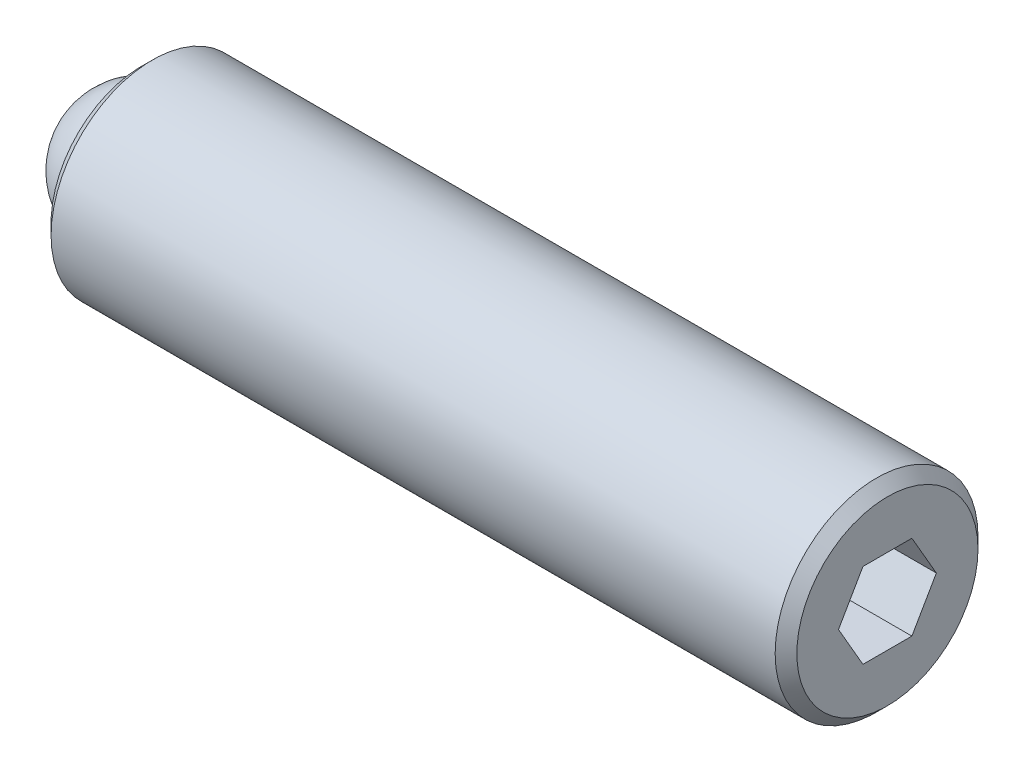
ISO-10303-21;
HEADER;
FILE_DESCRIPTION(('STEP AP214'),'2;1');
FILE_NAME('part.step','',(''),(''),'','','');
FILE_SCHEMA(('AUTOMOTIVE_DESIGN { 1 0 10303 214 1 1 1 1 }'));
ENDSEC;
DATA;
#1=APPLICATION_CONTEXT('core data for automotive mechanical design processes');
#2=APPLICATION_PROTOCOL_DEFINITION('international standard','automotive_design',2000,#1);
#3=PRODUCT_CONTEXT('',#1,'mechanical');
#4=PRODUCT('Part','Part','',(#3));
#5=PRODUCT_RELATED_PRODUCT_CATEGORY('part','',(#4));
#6=PRODUCT_DEFINITION_FORMATION('','',#4);
#7=PRODUCT_DEFINITION_CONTEXT('part definition',#1,'design');
#8=PRODUCT_DEFINITION('design','',#6,#7);
#9=PRODUCT_DEFINITION_SHAPE('','',#8);
#10=(LENGTH_UNIT() NAMED_UNIT(*) SI_UNIT(.MILLI.,.METRE.));
#11=(NAMED_UNIT(*) PLANE_ANGLE_UNIT() SI_UNIT($,.RADIAN.));
#12=(NAMED_UNIT(*) SI_UNIT($,.STERADIAN.) SOLID_ANGLE_UNIT());
#13=UNCERTAINTY_MEASURE_WITH_UNIT(LENGTH_MEASURE(1.E-05),#10,'distance_accuracy_value','');
#14=(GEOMETRIC_REPRESENTATION_CONTEXT(3) GLOBAL_UNCERTAINTY_ASSIGNED_CONTEXT((#13)) GLOBAL_UNIT_ASSIGNED_CONTEXT((#10,
#11,#12)) REPRESENTATION_CONTEXT('',''));
#15=CARTESIAN_POINT('',(0.,0.,0.));
#16=DIRECTION('',(0.,0.,1.));
#17=DIRECTION('',(1.,0.,0.));
#18=AXIS2_PLACEMENT_3D('',#15,#16,#17);
#19=CARTESIAN_POINT('',(0.,0.,0.));
#20=DIRECTION('',(0.,-1.,0.));
#21=DIRECTION('',(0.,0.,1.));
#22=AXIS2_PLACEMENT_3D('',#19,#20,#21);
#23=SPHERICAL_SURFACE('',#22,1.5875);
#24=CARTESIAN_POINT('',(0.,-1.5875,0.));
#25=VERTEX_POINT('',#24);
#26=VERTEX_LOOP('',#25);
#27=FACE_BOUND('',#26,.T.);
#28=ADVANCED_FACE('F41',(#27),#23,.T.);
#29=CLOSED_SHELL('',(#28));
#30=MANIFOLD_SOLID_BREP('B2',#29);
#31=CARTESIAN_POINT('',(17.4625,0.,0.));
#32=DIRECTION('',(-1.,0.,0.));
#33=DIRECTION('',(0.,0.,1.));
#34=AXIS2_PLACEMENT_3D('',#31,#32,#33);
#35=CYLINDRICAL_SURFACE('',#34,2.3749);
#36=CARTESIAN_POINT('',(17.2085,0.,0.));
#37=DIRECTION('',(1.,0.,0.));
#38=DIRECTION('',(0.,0.,-1.));
#39=AXIS2_PLACEMENT_3D('',#36,#37,#38);
#40=CIRCLE('',#39,2.3749);
#41=CARTESIAN_POINT('',(17.2085,0.,-2.3749));
#42=VERTEX_POINT('',#41);
#43=EDGE_CURVE('E39',#42,#42,#40,.F.);
#44=ORIENTED_EDGE('',*,*,#43,.T.);
#45=EDGE_LOOP('',(#44));
#46=FACE_BOUND('',#45,.T.);
#47=CARTESIAN_POINT('',(0.254000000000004,0.,0.));
#48=DIRECTION('',(1.,0.,0.));
#49=DIRECTION('',(0.,0.,-1.));
#50=AXIS2_PLACEMENT_3D('',#47,#48,#49);
#51=CIRCLE('',#50,2.3749);
#52=CARTESIAN_POINT('',(0.254000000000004,0.,-2.3749));
#53=VERTEX_POINT('',#52);
#54=EDGE_CURVE('E157',#53,#53,#51,.T.);
#55=ORIENTED_EDGE('',*,*,#54,.T.);
#56=EDGE_LOOP('',(#55));
#57=FACE_BOUND('',#56,.T.);
#58=ADVANCED_FACE('F54',(#46,#57),#35,.T.);
#59=CARTESIAN_POINT('',(17.4625,0.,0.));
#60=DIRECTION('',(1.,0.,0.));
#61=DIRECTION('',(0.,0.,-1.));
#62=AXIS2_PLACEMENT_3D('',#59,#60,#61);
#63=PLANE('',#62);
#64=DIRECTION('',(0.,0.866025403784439,-0.5));
#65=VECTOR('',#64,1.);
#66=CARTESIAN_POINT('',(17.4625,-0.992187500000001,-0.572839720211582));
#67=LINE('',#66,#65);
#68=CARTESIAN_POINT('',(17.4625,-0.992187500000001,-0.572839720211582));
#69=VERTEX_POINT('',#68);
#70=CARTESIAN_POINT('',(17.4625,0.,-1.14567944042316));
#71=VERTEX_POINT('',#70);
#72=EDGE_CURVE('E69',#69,#71,#67,.T.);
#73=ORIENTED_EDGE('',*,*,#72,.F.);
#74=DIRECTION('',(0.,0.,-1.));
#75=VECTOR('',#74,1.);
#76=CARTESIAN_POINT('',(17.4625,-0.992187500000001,0.572839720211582));
#77=LINE('',#76,#75);
#78=CARTESIAN_POINT('',(17.4625,-0.992187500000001,0.572839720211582));
#79=VERTEX_POINT('',#78);
#80=EDGE_CURVE('E153',#79,#69,#77,.T.);
#81=ORIENTED_EDGE('',*,*,#80,.F.);
#82=DIRECTION('',(0.,-0.866025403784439,-0.5));
#83=VECTOR('',#82,1.);
#84=CARTESIAN_POINT('',(17.4625,0.,1.14567944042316));
#85=LINE('',#84,#83);
#86=CARTESIAN_POINT('',(17.4625,0.,1.14567944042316));
#87=VERTEX_POINT('',#86);
#88=EDGE_CURVE('E151',#87,#79,#85,.T.);
#89=ORIENTED_EDGE('',*,*,#88,.F.);
#90=DIRECTION('',(0.,-0.866025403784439,0.5));
#91=VECTOR('',#90,1.);
#92=CARTESIAN_POINT('',(17.4625,0.992187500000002,0.572839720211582));
#93=LINE('',#92,#91);
#94=CARTESIAN_POINT('',(17.4625,0.992187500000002,0.572839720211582));
#95=VERTEX_POINT('',#94);
#96=EDGE_CURVE('E117',#95,#87,#93,.T.);
#97=ORIENTED_EDGE('',*,*,#96,.F.);
#98=DIRECTION('',(0.,0.,1.));
#99=VECTOR('',#98,1.);
#100=CARTESIAN_POINT('',(17.4625,0.992187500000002,-0.572839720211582));
#101=LINE('',#100,#99);
#102=CARTESIAN_POINT('',(17.4625,0.992187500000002,-0.572839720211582));
#103=VERTEX_POINT('',#102);
#104=EDGE_CURVE('E147',#103,#95,#101,.T.);
#105=ORIENTED_EDGE('',*,*,#104,.F.);
#106=DIRECTION('',(0.,0.866025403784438,0.5));
#107=VECTOR('',#106,1.);
#108=CARTESIAN_POINT('',(17.4625,0.,-1.14567944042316));
#109=LINE('',#108,#107);
#110=EDGE_CURVE('E143',#71,#103,#109,.T.);
#111=ORIENTED_EDGE('',*,*,#110,.F.);
#112=EDGE_LOOP('',(#73,#81,#89,#97,#105,#111));
#113=FACE_BOUND('',#112,.T.);
#114=CARTESIAN_POINT('',(17.4625,0.,0.));
#115=DIRECTION('',(1.,0.,0.));
#116=DIRECTION('',(0.,0.,-1.));
#117=AXIS2_PLACEMENT_3D('',#114,#115,#116);
#118=CIRCLE('',#117,2.1209);
#119=CARTESIAN_POINT('',(17.4625,0.,-2.1209));
#120=VERTEX_POINT('',#119);
#121=EDGE_CURVE('E62',#120,#120,#118,.T.);
#122=ORIENTED_EDGE('',*,*,#121,.T.);
#123=EDGE_LOOP('',(#122));
#124=FACE_BOUND('',#123,.T.);
#125=ADVANCED_FACE('F170',(#113,#124),#63,.T.);
#126=CARTESIAN_POINT('',(0.,0.,0.));
#127=DIRECTION('',(1.,0.,0.));
#128=DIRECTION('',(0.,0.,-1.));
#129=AXIS2_PLACEMENT_3D('',#126,#127,#128);
#130=PLANE('',#129);
#131=CARTESIAN_POINT('',(0.,0.,0.));
#132=DIRECTION('',(-1.,0.,0.));
#133=DIRECTION('',(0.,0.,1.));
#134=AXIS2_PLACEMENT_3D('',#131,#132,#133);
#135=CIRCLE('',#134,1.5875);
#136=CARTESIAN_POINT('',(0.,0.,1.5875));
#137=VERTEX_POINT('',#136);
#138=EDGE_CURVE('E225',#137,#137,#135,.T.);
#139=ORIENTED_EDGE('',*,*,#138,.F.);
#140=EDGE_LOOP('',(#139));
#141=FACE_BOUND('',#140,.T.);
#142=CARTESIAN_POINT('',(0.,0.,0.));
#143=DIRECTION('',(1.,0.,0.));
#144=DIRECTION('',(0.,0.,-1.));
#145=AXIS2_PLACEMENT_3D('',#142,#143,#144);
#146=CIRCLE('',#145,2.12089999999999);
#147=CARTESIAN_POINT('',(0.,0.,-2.12089999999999));
#148=VERTEX_POINT('',#147);
#149=EDGE_CURVE('E165',#148,#148,#146,.F.);
#150=ORIENTED_EDGE('',*,*,#149,.T.);
#151=EDGE_LOOP('',(#150));
#152=FACE_BOUND('',#151,.T.);
#153=ADVANCED_FACE('F182',(#141,#152),#130,.F.);
#154=CARTESIAN_POINT('',(0.254000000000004,0.,0.));
#155=DIRECTION('',(1.,0.,0.));
#156=DIRECTION('',(0.,0.,-1.));
#157=AXIS2_PLACEMENT_3D('',#154,#155,#156);
#158=CONICAL_SURFACE('',#157,2.3749,0.785398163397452);
#159=ORIENTED_EDGE('',*,*,#149,.F.);
#160=EDGE_LOOP('',(#159));
#161=FACE_BOUND('',#160,.T.);
#162=ORIENTED_EDGE('',*,*,#54,.F.);
#163=EDGE_LOOP('',(#162));
#164=FACE_BOUND('',#163,.T.);
#165=ADVANCED_FACE('F174',(#161,#164),#158,.T.);
#166=CARTESIAN_POINT('',(17.4625,0.,0.));
#167=DIRECTION('',(-1.,0.,0.));
#168=DIRECTION('',(0.,0.,1.));
#169=AXIS2_PLACEMENT_3D('',#166,#167,#168);
#170=CONICAL_SURFACE('',#169,2.1209,0.785398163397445);
#171=ORIENTED_EDGE('',*,*,#43,.F.);
#172=EDGE_LOOP('',(#171));
#173=FACE_BOUND('',#172,.T.);
#174=ORIENTED_EDGE('',*,*,#121,.F.);
#175=EDGE_LOOP('',(#174));
#176=FACE_BOUND('',#175,.T.);
#177=ADVANCED_FACE('F56',(#173,#176),#170,.T.);
#178=CARTESIAN_POINT('',(15.1765,-0.992187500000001,-0.572839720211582));
#179=DIRECTION('',(0.,-0.5,-0.866025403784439));
#180=DIRECTION('',(0.,0.866025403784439,-0.5));
#181=AXIS2_PLACEMENT_3D('',#178,#179,#180);
#182=PLANE('',#181);
#183=ORIENTED_EDGE('',*,*,#72,.T.);
#184=DIRECTION('',(1.,0.,0.));
#185=VECTOR('',#184,1.);
#186=CARTESIAN_POINT('',(15.1765,0.,-1.14567944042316));
#187=LINE('',#186,#185);
#188=CARTESIAN_POINT('',(15.1765,0.,-1.14567944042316));
#189=VERTEX_POINT('',#188);
#190=EDGE_CURVE('E99',#189,#71,#187,.T.);
#191=ORIENTED_EDGE('',*,*,#190,.F.);
#192=DIRECTION('',(0.,0.866025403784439,-0.5));
#193=VECTOR('',#192,1.);
#194=CARTESIAN_POINT('',(15.1765,-0.992187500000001,-0.572839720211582));
#195=LINE('',#194,#193);
#196=CARTESIAN_POINT('',(15.1765,-0.992187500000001,-0.572839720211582));
#197=VERTEX_POINT('',#196);
#198=EDGE_CURVE('E155',#197,#189,#195,.T.);
#199=ORIENTED_EDGE('',*,*,#198,.F.);
#200=DIRECTION('',(1.,0.,0.));
#201=VECTOR('',#200,1.);
#202=CARTESIAN_POINT('',(15.1765,-0.992187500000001,-0.572839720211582));
#203=LINE('',#202,#201);
#204=EDGE_CURVE('E77',#197,#69,#203,.T.);
#205=ORIENTED_EDGE('',*,*,#204,.T.);
#206=EDGE_LOOP('',(#183,#191,#199,#205));
#207=FACE_BOUND('',#206,.T.);
#208=ADVANCED_FACE('F173',(#207),#182,.F.);
#209=CARTESIAN_POINT('',(15.1765,-0.992187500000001,0.572839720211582));
#210=DIRECTION('',(0.,-1.,0.));
#211=DIRECTION('',(0.,0.,-1.));
#212=AXIS2_PLACEMENT_3D('',#209,#210,#211);
#213=PLANE('',#212);
#214=ORIENTED_EDGE('',*,*,#80,.T.);
#215=ORIENTED_EDGE('',*,*,#204,.F.);
#216=DIRECTION('',(0.,0.,-1.));
#217=VECTOR('',#216,1.);
#218=CARTESIAN_POINT('',(15.1765,-0.992187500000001,0.572839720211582));
#219=LINE('',#218,#217);
#220=CARTESIAN_POINT('',(15.1765,-0.992187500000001,0.572839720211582));
#221=VERTEX_POINT('',#220);
#222=EDGE_CURVE('E129',#221,#197,#219,.T.);
#223=ORIENTED_EDGE('',*,*,#222,.F.);
#224=DIRECTION('',(1.,0.,0.));
#225=VECTOR('',#224,1.);
#226=CARTESIAN_POINT('',(15.1765,-0.992187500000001,0.572839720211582));
#227=LINE('',#226,#225);
#228=EDGE_CURVE('E121',#221,#79,#227,.T.);
#229=ORIENTED_EDGE('',*,*,#228,.T.);
#230=EDGE_LOOP('',(#214,#215,#223,#229));
#231=FACE_BOUND('',#230,.T.);
#232=ADVANCED_FACE('F180',(#231),#213,.F.);
#233=CARTESIAN_POINT('',(15.1765,0.,1.14567944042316));
#234=DIRECTION('',(0.,-0.5,0.866025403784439));
#235=DIRECTION('',(0.,-0.866025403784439,-0.5));
#236=AXIS2_PLACEMENT_3D('',#233,#234,#235);
#237=PLANE('',#236);
#238=ORIENTED_EDGE('',*,*,#88,.T.);
#239=ORIENTED_EDGE('',*,*,#228,.F.);
#240=DIRECTION('',(0.,-0.866025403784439,-0.5));
#241=VECTOR('',#240,1.);
#242=CARTESIAN_POINT('',(15.1765,0.,1.14567944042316));
#243=LINE('',#242,#241);
#244=CARTESIAN_POINT('',(15.1765,0.,1.14567944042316));
#245=VERTEX_POINT('',#244);
#246=EDGE_CURVE('E125',#245,#221,#243,.T.);
#247=ORIENTED_EDGE('',*,*,#246,.F.);
#248=DIRECTION('',(1.,0.,0.));
#249=VECTOR('',#248,1.);
#250=CARTESIAN_POINT('',(15.1765,0.,1.14567944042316));
#251=LINE('',#250,#249);
#252=EDGE_CURVE('E110',#245,#87,#251,.T.);
#253=ORIENTED_EDGE('',*,*,#252,.T.);
#254=EDGE_LOOP('',(#238,#239,#247,#253));
#255=FACE_BOUND('',#254,.T.);
#256=ADVANCED_FACE('F126',(#255),#237,.F.);
#257=CARTESIAN_POINT('',(15.1765,0.992187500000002,0.572839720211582));
#258=DIRECTION('',(0.,0.5,0.866025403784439));
#259=DIRECTION('',(0.,-0.866025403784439,0.5));
#260=AXIS2_PLACEMENT_3D('',#257,#258,#259);
#261=PLANE('',#260);
#262=ORIENTED_EDGE('',*,*,#96,.T.);
#263=ORIENTED_EDGE('',*,*,#252,.F.);
#264=DIRECTION('',(0.,-0.866025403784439,0.5));
#265=VECTOR('',#264,1.);
#266=CARTESIAN_POINT('',(15.1765,0.992187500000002,0.572839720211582));
#267=LINE('',#266,#265);
#268=CARTESIAN_POINT('',(15.1765,0.992187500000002,0.572839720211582));
#269=VERTEX_POINT('',#268);
#270=EDGE_CURVE('E114',#269,#245,#267,.T.);
#271=ORIENTED_EDGE('',*,*,#270,.F.);
#272=DIRECTION('',(1.,0.,0.));
#273=VECTOR('',#272,1.);
#274=CARTESIAN_POINT('',(15.1765,0.992187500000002,0.572839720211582));
#275=LINE('',#274,#273);
#276=EDGE_CURVE('E122',#269,#95,#275,.T.);
#277=ORIENTED_EDGE('',*,*,#276,.T.);
#278=EDGE_LOOP('',(#262,#263,#271,#277));
#279=FACE_BOUND('',#278,.T.);
#280=ADVANCED_FACE('F112',(#279),#261,.F.);
#281=CARTESIAN_POINT('',(15.1765,0.992187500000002,-0.572839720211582));
#282=DIRECTION('',(0.,1.,0.));
#283=DIRECTION('',(0.,0.,1.));
#284=AXIS2_PLACEMENT_3D('',#281,#282,#283);
#285=PLANE('',#284);
#286=ORIENTED_EDGE('',*,*,#104,.T.);
#287=ORIENTED_EDGE('',*,*,#276,.F.);
#288=DIRECTION('',(0.,0.,1.));
#289=VECTOR('',#288,1.);
#290=CARTESIAN_POINT('',(15.1765,0.992187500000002,-0.572839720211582));
#291=LINE('',#290,#289);
#292=CARTESIAN_POINT('',(15.1765,0.992187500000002,-0.572839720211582));
#293=VERTEX_POINT('',#292);
#294=EDGE_CURVE('E135',#293,#269,#291,.T.);
#295=ORIENTED_EDGE('',*,*,#294,.F.);
#296=DIRECTION('',(1.,0.,0.));
#297=VECTOR('',#296,1.);
#298=CARTESIAN_POINT('',(15.1765,0.992187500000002,-0.572839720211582));
#299=LINE('',#298,#297);
#300=EDGE_CURVE('E160',#293,#103,#299,.T.);
#301=ORIENTED_EDGE('',*,*,#300,.T.);
#302=EDGE_LOOP('',(#286,#287,#295,#301));
#303=FACE_BOUND('',#302,.T.);
#304=ADVANCED_FACE('F201',(#303),#285,.F.);
#305=CARTESIAN_POINT('',(15.1765,0.,-1.14567944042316));
#306=DIRECTION('',(0.,0.5,-0.866025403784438));
#307=DIRECTION('',(0.,0.866025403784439,0.5));
#308=AXIS2_PLACEMENT_3D('',#305,#306,#307);
#309=PLANE('',#308);
#310=ORIENTED_EDGE('',*,*,#110,.T.);
#311=ORIENTED_EDGE('',*,*,#300,.F.);
#312=DIRECTION('',(0.,0.866025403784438,0.5));
#313=VECTOR('',#312,1.);
#314=CARTESIAN_POINT('',(15.1765,0.,-1.14567944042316));
#315=LINE('',#314,#313);
#316=EDGE_CURVE('E137',#189,#293,#315,.T.);
#317=ORIENTED_EDGE('',*,*,#316,.F.);
#318=ORIENTED_EDGE('',*,*,#190,.T.);
#319=EDGE_LOOP('',(#310,#311,#317,#318));
#320=FACE_BOUND('',#319,.T.);
#321=ADVANCED_FACE('F198',(#320),#309,.F.);
#322=CARTESIAN_POINT('',(15.1765,0.,0.));
#323=DIRECTION('',(1.,0.,0.));
#324=DIRECTION('',(0.,0.,-1.));
#325=AXIS2_PLACEMENT_3D('',#322,#323,#324);
#326=PLANE('',#325);
#327=ORIENTED_EDGE('',*,*,#198,.T.);
#328=ORIENTED_EDGE('',*,*,#316,.T.);
#329=ORIENTED_EDGE('',*,*,#294,.T.);
#330=ORIENTED_EDGE('',*,*,#270,.T.);
#331=ORIENTED_EDGE('',*,*,#246,.T.);
#332=ORIENTED_EDGE('',*,*,#222,.T.);
#333=EDGE_LOOP('',(#327,#328,#329,#330,#331,#332));
#334=FACE_BOUND('',#333,.T.);
#335=ADVANCED_FACE('F132',(#334),#326,.T.);
#336=CARTESIAN_POINT('',(1.5875,0.,0.));
#337=DIRECTION('',(-1.,0.,0.));
#338=DIRECTION('',(0.,0.,1.));
#339=AXIS2_PLACEMENT_3D('',#336,#337,#338);
#340=CYLINDRICAL_SURFACE('',#339,1.5875);
#341=CARTESIAN_POINT('',(1.5875,0.,0.));
#342=DIRECTION('',(-1.,0.,0.));
#343=DIRECTION('',(0.,0.,1.));
#344=AXIS2_PLACEMENT_3D('',#341,#342,#343);
#345=CIRCLE('',#344,1.5875);
#346=CARTESIAN_POINT('',(1.5875,0.,1.5875));
#347=VERTEX_POINT('',#346);
#348=EDGE_CURVE('E144',#347,#347,#345,.T.);
#349=ORIENTED_EDGE('',*,*,#348,.F.);
#350=EDGE_LOOP('',(#349));
#351=FACE_BOUND('',#350,.T.);
#352=ORIENTED_EDGE('',*,*,#138,.T.);
#353=EDGE_LOOP('',(#352));
#354=FACE_BOUND('',#353,.T.);
#355=ADVANCED_FACE('F214',(#351,#354),#340,.F.);
#356=CARTESIAN_POINT('',(1.5875,0.,0.));
#357=DIRECTION('',(-1.,0.,0.));
#358=DIRECTION('',(0.,0.,1.));
#359=AXIS2_PLACEMENT_3D('',#356,#357,#358);
#360=PLANE('',#359);
#361=ORIENTED_EDGE('',*,*,#348,.T.);
#362=EDGE_LOOP('',(#361));
#363=FACE_BOUND('',#362,.T.);
#364=ADVANCED_FACE('F217',(#363),#360,.T.);
#365=CLOSED_SHELL('',(#58,#125,#153,#165,#177,#208,#232,#256,#280,#304,#321,#335,#355,#364));
#366=MANIFOLD_SOLID_BREP('B6',#365);
#367=ADVANCED_BREP_SHAPE_REPRESENTATION('',(#18,#30,#366),#14);
#368=SHAPE_DEFINITION_REPRESENTATION(#9,#367);
ENDSEC;
END-ISO-10303-21;
